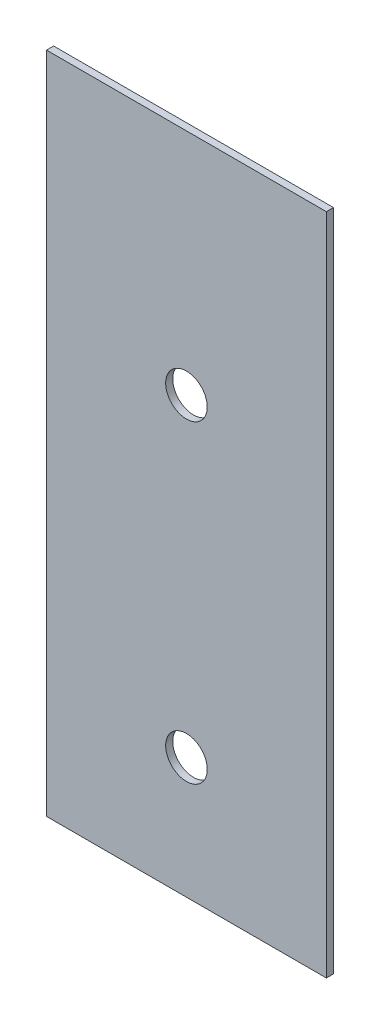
from build123d import *

# Parameters (mm, degrees)
SKETCH1_W             = 469.9
SKETCH1_H             = 1114.425
BOSS_EXTRUDE1_DEPTH   = 11.90625
F_2_CLEARANCE_HOLE1_D = 69.85


with BuildPart() as part:
    # Sketch1 → Boss-Extrude1 (new body)
    with BuildSketch(Plane.XY):
        Rectangle(SKETCH1_W, SKETCH1_H)
    extrude(amount=BOSS_EXTRUDE1_DEPTH)

    # 2 Clearance Hole1 (through all)
    with Locations(Plane.XY.offset(11.90625)):
        with Locations((0, 173.0375), (0, -354.0125)):
            Hole(F_2_CLEARANCE_HOLE1_D / 2)


solid = part.part
